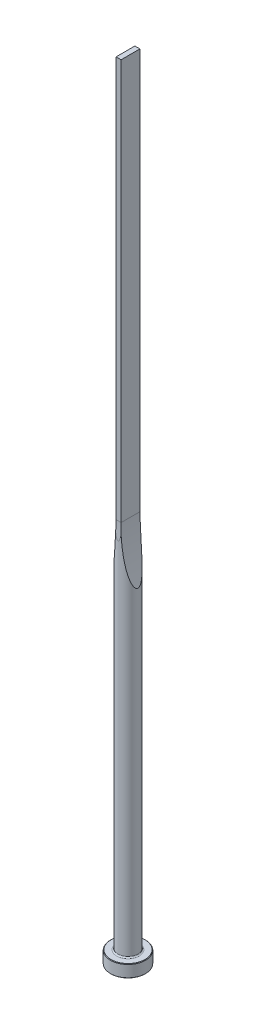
from build123d import *

# Parameters (mm, degrees)
CUT_EXTRUDE1_DEPTH = 5
CUT_EXTRUDE2_DEPTH = 5


with BuildPart() as part:
    # Sketch1 → Revolve1 (revolve)
    with BuildSketch(Plane.XY, mode=Mode.PRIVATE) as revolve1_sk:
        with BuildLine():
            Line((0, 0), (6.8, 0))
            Line((6.8, 0), (7, 0.2))
            Line((7, 0.2), (7, 4.8))
            Line((7, 4.8), (6.8, 5))
            Line((6.8, 5), (4.5, 5))
            ThreePointArc((4.5, 5), (4.146446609, 5.146446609), (4, 5.5))
            Line((4, 5.5), (4, 315))
            Line((4, 315), (0, 315))
            Line((0, 315), (0, 0))
        make_face()
    revolve(revolve1_sk.sketch.rotate(Axis((0, 315, 0), (0, -1, 0)), 180), axis=Axis((0, 315, 0), (0, -1, 0)))

    # Sketch2 → Cut-Extrude1 (cut, symmetric)
    with BuildSketch(Plane.XY):
        with BuildLine():
            Line((1, 315), (1, 155))
            ThreePointArc((1, 155), (1.753151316, 143.381049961), (4, 131.956562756))
            Line((4, 131.956562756), (4, 315))
            Line((4, 315), (1, 315))
        make_face()
        with BuildLine():
            Line((-1, 315), (-1, 155))
            ThreePointArc((-1, 155), (-1.753151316, 143.381049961), (-4, 131.956562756))
            Line((-4, 131.956562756), (-4, 315))
            Line((-4, 315), (-1, 315))
        make_face()
    extrude(amount=CUT_EXTRUDE1_DEPTH, both=True, mode=Mode.SUBTRACT)

    # Sketch3 → Cut-Extrude2 (cut, symmetric)
    with BuildSketch(Plane(origin=(0, 0, 0), x_dir=(0, 0, -1), z_dir=(1, 0, 0))):
        with BuildLine():
            Line((3.75, 315), (3.75, 155))
            ThreePointArc((3.75, 155), (3.812521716, 151.645898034), (4, 148.296456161))
            Line((4, 148.296456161), (4, 315))
            Line((4, 315), (3.75, 315))
        make_face()
        with BuildLine():
            Line((-3.75, 315), (-3.75, 155))
            ThreePointArc((-3.75, 155), (-3.812521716, 151.645898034), (-4, 148.296456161))
            Line((-4, 148.296456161), (-4, 315))
            Line((-4, 315), (-3.75, 315))
        make_face()
    extrude(amount=CUT_EXTRUDE2_DEPTH, both=True, mode=Mode.SUBTRACT)


solid = part.part
